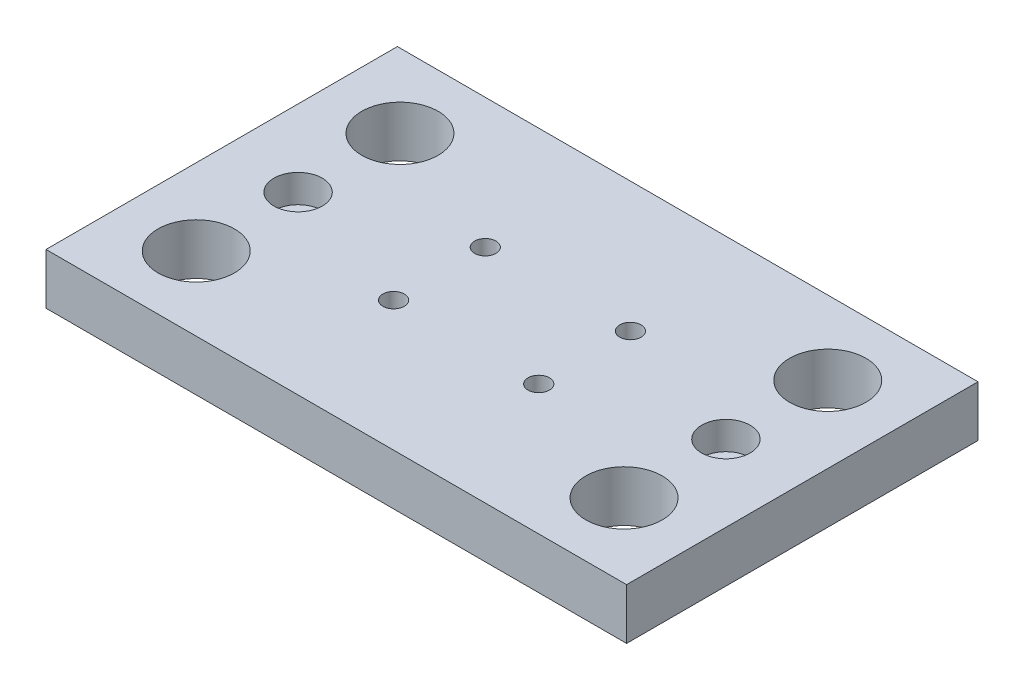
ISO-10303-21;
HEADER;
FILE_DESCRIPTION(('STEP AP214'),'2;1');
FILE_NAME('part.step','',(''),(''),'','','');
FILE_SCHEMA(('AUTOMOTIVE_DESIGN { 1 0 10303 214 1 1 1 1 }'));
ENDSEC;
DATA;
#1=APPLICATION_CONTEXT('core data for automotive mechanical design processes');
#2=APPLICATION_PROTOCOL_DEFINITION('international standard','automotive_design',2000,#1);
#3=PRODUCT_CONTEXT('',#1,'mechanical');
#4=PRODUCT('Part','Part','',(#3));
#5=PRODUCT_RELATED_PRODUCT_CATEGORY('part','',(#4));
#6=PRODUCT_DEFINITION_FORMATION('','',#4);
#7=PRODUCT_DEFINITION_CONTEXT('part definition',#1,'design');
#8=PRODUCT_DEFINITION('design','',#6,#7);
#9=PRODUCT_DEFINITION_SHAPE('','',#8);
#10=(LENGTH_UNIT() NAMED_UNIT(*) SI_UNIT(.MILLI.,.METRE.));
#11=(NAMED_UNIT(*) PLANE_ANGLE_UNIT() SI_UNIT($,.RADIAN.));
#12=(NAMED_UNIT(*) SI_UNIT($,.STERADIAN.) SOLID_ANGLE_UNIT());
#13=UNCERTAINTY_MEASURE_WITH_UNIT(LENGTH_MEASURE(1.E-05),#10,'distance_accuracy_value','');
#14=(GEOMETRIC_REPRESENTATION_CONTEXT(3) GLOBAL_UNCERTAINTY_ASSIGNED_CONTEXT((#13)) GLOBAL_UNIT_ASSIGNED_CONTEXT((#10,
#11,#12)) REPRESENTATION_CONTEXT('',''));
#15=CARTESIAN_POINT('',(0.,0.,0.));
#16=DIRECTION('',(0.,0.,1.));
#17=DIRECTION('',(1.,0.,0.));
#18=AXIS2_PLACEMENT_3D('',#15,#16,#17);
#19=CARTESIAN_POINT('',(99.,-59.,34.5));
#20=DIRECTION('',(0.,1.,0.));
#21=DIRECTION('',(0.,0.,1.));
#22=AXIS2_PLACEMENT_3D('',#19,#20,#21);
#23=CYLINDRICAL_SURFACE('',#22,2.75);
#24=CARTESIAN_POINT('',(99.,0.,34.5));
#25=DIRECTION('',(0.,1.,0.));
#26=DIRECTION('',(0.,0.,1.));
#27=AXIS2_PLACEMENT_3D('',#24,#25,#26);
#28=CIRCLE('',#27,2.75);
#29=CARTESIAN_POINT('',(99.,0.,37.25));
#30=VERTEX_POINT('',#29);
#31=EDGE_CURVE('E147',#30,#30,#28,.T.);
#32=ORIENTED_EDGE('',*,*,#31,.F.);
#33=EDGE_LOOP('',(#32));
#34=FACE_BOUND('',#33,.T.);
#35=CARTESIAN_POINT('',(99.,4.5,34.5));
#36=DIRECTION('',(0.,1.,0.));
#37=DIRECTION('',(0.,0.,1.));
#38=AXIS2_PLACEMENT_3D('',#35,#36,#37);
#39=CIRCLE('',#38,2.75);
#40=CARTESIAN_POINT('',(99.,4.5,37.25));
#41=VERTEX_POINT('',#40);
#42=EDGE_CURVE('E36',#41,#41,#39,.F.);
#43=ORIENTED_EDGE('',*,*,#42,.F.);
#44=EDGE_LOOP('',(#43));
#45=FACE_BOUND('',#44,.T.);
#46=ADVANCED_FACE('F32',(#34,#45),#23,.F.);
#47=CARTESIAN_POINT('',(15.,-59.,34.5));
#48=DIRECTION('',(0.,1.,0.));
#49=DIRECTION('',(0.,0.,1.));
#50=AXIS2_PLACEMENT_3D('',#47,#48,#49);
#51=CYLINDRICAL_SURFACE('',#50,2.75);
#52=CARTESIAN_POINT('',(15.,0.,34.5));
#53=DIRECTION('',(0.,1.,0.));
#54=DIRECTION('',(0.,0.,1.));
#55=AXIS2_PLACEMENT_3D('',#52,#53,#54);
#56=CIRCLE('',#55,2.75);
#57=CARTESIAN_POINT('',(15.,0.,37.25));
#58=VERTEX_POINT('',#57);
#59=EDGE_CURVE('E150',#58,#58,#56,.T.);
#60=ORIENTED_EDGE('',*,*,#59,.F.);
#61=EDGE_LOOP('',(#60));
#62=FACE_BOUND('',#61,.T.);
#63=CARTESIAN_POINT('',(15.,4.5,34.5));
#64=DIRECTION('',(0.,1.,0.));
#65=DIRECTION('',(0.,0.,1.));
#66=AXIS2_PLACEMENT_3D('',#63,#64,#65);
#67=CIRCLE('',#66,2.75);
#68=CARTESIAN_POINT('',(15.,4.5,37.25));
#69=VERTEX_POINT('',#68);
#70=EDGE_CURVE('E107',#69,#69,#67,.F.);
#71=ORIENTED_EDGE('',*,*,#70,.F.);
#72=EDGE_LOOP('',(#71));
#73=FACE_BOUND('',#72,.T.);
#74=ADVANCED_FACE('F195',(#62,#73),#51,.F.);
#75=CARTESIAN_POINT('',(0.,0.,69.));
#76=DIRECTION('',(1.,0.,0.));
#77=DIRECTION('',(0.,0.,-1.));
#78=AXIS2_PLACEMENT_3D('',#75,#76,#77);
#79=PLANE('',#78);
#80=DIRECTION('',(0.,-1.,0.));
#81=VECTOR('',#80,1.);
#82=CARTESIAN_POINT('',(0.,0.,0.));
#83=LINE('',#82,#81);
#84=CARTESIAN_POINT('',(0.,10.,0.));
#85=VERTEX_POINT('',#84);
#86=CARTESIAN_POINT('',(0.,0.,0.));
#87=VERTEX_POINT('',#86);
#88=EDGE_CURVE('E99',#85,#87,#83,.T.);
#89=ORIENTED_EDGE('',*,*,#88,.T.);
#90=DIRECTION('',(0.,0.,-1.));
#91=VECTOR('',#90,1.);
#92=CARTESIAN_POINT('',(0.,0.,69.));
#93=LINE('',#92,#91);
#94=CARTESIAN_POINT('',(0.,0.,69.));
#95=VERTEX_POINT('',#94);
#96=EDGE_CURVE('E11',#95,#87,#93,.T.);
#97=ORIENTED_EDGE('',*,*,#96,.F.);
#98=DIRECTION('',(0.,-1.,0.));
#99=VECTOR('',#98,1.);
#100=CARTESIAN_POINT('',(0.,0.,69.));
#101=LINE('',#100,#99);
#102=CARTESIAN_POINT('',(0.,10.,69.));
#103=VERTEX_POINT('',#102);
#104=EDGE_CURVE('E86',#103,#95,#101,.T.);
#105=ORIENTED_EDGE('',*,*,#104,.F.);
#106=DIRECTION('',(0.,0.,-1.));
#107=VECTOR('',#106,1.);
#108=CARTESIAN_POINT('',(0.,10.,69.));
#109=LINE('',#108,#107);
#110=EDGE_CURVE('E95',#103,#85,#109,.T.);
#111=ORIENTED_EDGE('',*,*,#110,.T.);
#112=EDGE_LOOP('',(#89,#97,#105,#111));
#113=FACE_BOUND('',#112,.T.);
#114=ADVANCED_FACE('F34',(#113),#79,.F.);
#115=CARTESIAN_POINT('',(0.,0.,69.));
#116=DIRECTION('',(0.,1.,0.));
#117=DIRECTION('',(0.,0.,1.));
#118=AXIS2_PLACEMENT_3D('',#115,#116,#117);
#119=PLANE('',#118);
#120=CARTESIAN_POINT('',(71.25,0.,43.5));
#121=DIRECTION('',(0.,1.,0.));
#122=DIRECTION('',(0.,0.,1.));
#123=AXIS2_PLACEMENT_3D('',#120,#121,#122);
#124=CIRCLE('',#123,2.1);
#125=CARTESIAN_POINT('',(71.25,0.,45.6));
#126=VERTEX_POINT('',#125);
#127=EDGE_CURVE('E114',#126,#126,#124,.T.);
#128=ORIENTED_EDGE('',*,*,#127,.T.);
#129=EDGE_LOOP('',(#128));
#130=FACE_BOUND('',#129,.T.);
#131=CARTESIAN_POINT('',(71.25,0.,25.5));
#132=DIRECTION('',(0.,1.,0.));
#133=DIRECTION('',(0.,0.,1.));
#134=AXIS2_PLACEMENT_3D('',#131,#132,#133);
#135=CIRCLE('',#134,2.1);
#136=CARTESIAN_POINT('',(71.25,0.,27.6));
#137=VERTEX_POINT('',#136);
#138=EDGE_CURVE('E132',#137,#137,#135,.T.);
#139=ORIENTED_EDGE('',*,*,#138,.T.);
#140=EDGE_LOOP('',(#139));
#141=FACE_BOUND('',#140,.T.);
#142=CARTESIAN_POINT('',(42.75,0.,25.5));
#143=DIRECTION('',(0.,1.,0.));
#144=DIRECTION('',(0.,0.,1.));
#145=AXIS2_PLACEMENT_3D('',#142,#143,#144);
#146=CIRCLE('',#145,2.1);
#147=CARTESIAN_POINT('',(42.75,0.,27.6));
#148=VERTEX_POINT('',#147);
#149=EDGE_CURVE('E138',#148,#148,#146,.T.);
#150=ORIENTED_EDGE('',*,*,#149,.T.);
#151=EDGE_LOOP('',(#150));
#152=FACE_BOUND('',#151,.T.);
#153=CARTESIAN_POINT('',(42.75,0.,43.5));
#154=DIRECTION('',(0.,1.,0.));
#155=DIRECTION('',(0.,0.,1.));
#156=AXIS2_PLACEMENT_3D('',#153,#154,#155);
#157=CIRCLE('',#156,2.1);
#158=CARTESIAN_POINT('',(42.75,0.,45.6));
#159=VERTEX_POINT('',#158);
#160=EDGE_CURVE('E144',#159,#159,#157,.T.);
#161=ORIENTED_EDGE('',*,*,#160,.T.);
#162=EDGE_LOOP('',(#161));
#163=FACE_BOUND('',#162,.T.);
#164=ORIENTED_EDGE('',*,*,#31,.T.);
#165=EDGE_LOOP('',(#164));
#166=FACE_BOUND('',#165,.T.);
#167=ORIENTED_EDGE('',*,*,#59,.T.);
#168=EDGE_LOOP('',(#167));
#169=FACE_BOUND('',#168,.T.);
#170=CARTESIAN_POINT('',(15.,0.,54.5));
#171=DIRECTION('',(0.,1.,0.));
#172=DIRECTION('',(0.,0.,1.));
#173=AXIS2_PLACEMENT_3D('',#170,#171,#172);
#174=CIRCLE('',#173,7.5);
#175=CARTESIAN_POINT('',(15.,0.,62.));
#176=VERTEX_POINT('',#175);
#177=EDGE_CURVE('E156',#176,#176,#174,.T.);
#178=ORIENTED_EDGE('',*,*,#177,.T.);
#179=EDGE_LOOP('',(#178));
#180=FACE_BOUND('',#179,.T.);
#181=CARTESIAN_POINT('',(99.,0.,54.5));
#182=DIRECTION('',(0.,1.,0.));
#183=DIRECTION('',(0.,0.,1.));
#184=AXIS2_PLACEMENT_3D('',#181,#182,#183);
#185=CIRCLE('',#184,7.50000000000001);
#186=CARTESIAN_POINT('',(99.,0.,62.));
#187=VERTEX_POINT('',#186);
#188=EDGE_CURVE('E162',#187,#187,#185,.T.);
#189=ORIENTED_EDGE('',*,*,#188,.T.);
#190=EDGE_LOOP('',(#189));
#191=FACE_BOUND('',#190,.T.);
#192=CARTESIAN_POINT('',(99.,0.,14.5));
#193=DIRECTION('',(0.,1.,0.));
#194=DIRECTION('',(0.,0.,1.));
#195=AXIS2_PLACEMENT_3D('',#192,#193,#194);
#196=CIRCLE('',#195,7.50000000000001);
#197=CARTESIAN_POINT('',(99.,0.,22.));
#198=VERTEX_POINT('',#197);
#199=EDGE_CURVE('E168',#198,#198,#196,.T.);
#200=ORIENTED_EDGE('',*,*,#199,.T.);
#201=EDGE_LOOP('',(#200));
#202=FACE_BOUND('',#201,.T.);
#203=CARTESIAN_POINT('',(15.,0.,14.5));
#204=DIRECTION('',(0.,1.,0.));
#205=DIRECTION('',(0.,0.,1.));
#206=AXIS2_PLACEMENT_3D('',#203,#204,#205);
#207=CIRCLE('',#206,7.5);
#208=CARTESIAN_POINT('',(15.,0.,22.));
#209=VERTEX_POINT('',#208);
#210=EDGE_CURVE('E102',#209,#209,#207,.T.);
#211=ORIENTED_EDGE('',*,*,#210,.T.);
#212=EDGE_LOOP('',(#211));
#213=FACE_BOUND('',#212,.T.);
#214=DIRECTION('',(1.,0.,0.));
#215=VECTOR('',#214,1.);
#216=CARTESIAN_POINT('',(0.,0.,0.));
#217=LINE('',#216,#215);
#218=CARTESIAN_POINT('',(114.,0.,0.));
#219=VERTEX_POINT('',#218);
#220=EDGE_CURVE('E90',#87,#219,#217,.T.);
#221=ORIENTED_EDGE('',*,*,#220,.T.);
#222=DIRECTION('',(0.,0.,-1.));
#223=VECTOR('',#222,1.);
#224=CARTESIAN_POINT('',(114.,0.,69.));
#225=LINE('',#224,#223);
#226=CARTESIAN_POINT('',(114.,0.,69.));
#227=VERTEX_POINT('',#226);
#228=EDGE_CURVE('E42',#227,#219,#225,.T.);
#229=ORIENTED_EDGE('',*,*,#228,.F.);
#230=DIRECTION('',(1.,0.,0.));
#231=VECTOR('',#230,1.);
#232=CARTESIAN_POINT('',(0.,0.,69.));
#233=LINE('',#232,#231);
#234=EDGE_CURVE('E81',#95,#227,#233,.T.);
#235=ORIENTED_EDGE('',*,*,#234,.F.);
#236=ORIENTED_EDGE('',*,*,#96,.T.);
#237=EDGE_LOOP('',(#221,#229,#235,#236));
#238=FACE_BOUND('',#237,.T.);
#239=ADVANCED_FACE('F89',(#130,#141,#152,#163,#166,#169,#180,#191,#202,#213,#238),#119,.F.);
#240=CARTESIAN_POINT('',(114.,0.,69.));
#241=DIRECTION('',(-1.,0.,0.));
#242=DIRECTION('',(0.,0.,1.));
#243=AXIS2_PLACEMENT_3D('',#240,#241,#242);
#244=PLANE('',#243);
#245=DIRECTION('',(0.,1.,0.));
#246=VECTOR('',#245,1.);
#247=CARTESIAN_POINT('',(114.,0.,0.));
#248=LINE('',#247,#246);
#249=CARTESIAN_POINT('',(114.,10.,0.));
#250=VERTEX_POINT('',#249);
#251=EDGE_CURVE('E68',#219,#250,#248,.T.);
#252=ORIENTED_EDGE('',*,*,#251,.T.);
#253=DIRECTION('',(0.,0.,-1.));
#254=VECTOR('',#253,1.);
#255=CARTESIAN_POINT('',(114.,10.,69.));
#256=LINE('',#255,#254);
#257=CARTESIAN_POINT('',(114.,10.,69.));
#258=VERTEX_POINT('',#257);
#259=EDGE_CURVE('E91',#258,#250,#256,.T.);
#260=ORIENTED_EDGE('',*,*,#259,.F.);
#261=DIRECTION('',(0.,1.,0.));
#262=VECTOR('',#261,1.);
#263=CARTESIAN_POINT('',(114.,0.,69.));
#264=LINE('',#263,#262);
#265=EDGE_CURVE('E84',#227,#258,#264,.T.);
#266=ORIENTED_EDGE('',*,*,#265,.F.);
#267=ORIENTED_EDGE('',*,*,#228,.T.);
#268=EDGE_LOOP('',(#252,#260,#266,#267));
#269=FACE_BOUND('',#268,.T.);
#270=ADVANCED_FACE('F93',(#269),#244,.F.);
#271=CARTESIAN_POINT('',(0.,10.,69.));
#272=DIRECTION('',(0.,-1.,0.));
#273=DIRECTION('',(0.,0.,-1.));
#274=AXIS2_PLACEMENT_3D('',#271,#272,#273);
#275=PLANE('',#274);
#276=CARTESIAN_POINT('',(99.,10.,34.5));
#277=DIRECTION('',(0.,1.,0.));
#278=DIRECTION('',(0.,0.,1.));
#279=AXIS2_PLACEMENT_3D('',#276,#277,#278);
#280=CIRCLE('',#279,4.75);
#281=CARTESIAN_POINT('',(99.,10.,39.25));
#282=VERTEX_POINT('',#281);
#283=EDGE_CURVE('E124',#282,#282,#280,.T.);
#284=ORIENTED_EDGE('',*,*,#283,.F.);
#285=EDGE_LOOP('',(#284));
#286=FACE_BOUND('',#285,.T.);
#287=CARTESIAN_POINT('',(15.,10.,34.5));
#288=DIRECTION('',(0.,1.,0.));
#289=DIRECTION('',(0.,0.,1.));
#290=AXIS2_PLACEMENT_3D('',#287,#288,#289);
#291=CIRCLE('',#290,4.75);
#292=CARTESIAN_POINT('',(15.,10.,39.25));
#293=VERTEX_POINT('',#292);
#294=EDGE_CURVE('E117',#293,#293,#291,.T.);
#295=ORIENTED_EDGE('',*,*,#294,.F.);
#296=EDGE_LOOP('',(#295));
#297=FACE_BOUND('',#296,.T.);
#298=CARTESIAN_POINT('',(71.25,10.,43.5));
#299=DIRECTION('',(0.,1.,0.));
#300=DIRECTION('',(0.,0.,1.));
#301=AXIS2_PLACEMENT_3D('',#298,#299,#300);
#302=CIRCLE('',#301,2.1);
#303=CARTESIAN_POINT('',(71.25,10.,45.6));
#304=VERTEX_POINT('',#303);
#305=EDGE_CURVE('E109',#304,#304,#302,.T.);
#306=ORIENTED_EDGE('',*,*,#305,.F.);
#307=EDGE_LOOP('',(#306));
#308=FACE_BOUND('',#307,.T.);
#309=CARTESIAN_POINT('',(71.25,10.,25.5));
#310=DIRECTION('',(0.,1.,0.));
#311=DIRECTION('',(0.,0.,1.));
#312=AXIS2_PLACEMENT_3D('',#309,#310,#311);
#313=CIRCLE('',#312,2.1);
#314=CARTESIAN_POINT('',(71.25,10.,27.6));
#315=VERTEX_POINT('',#314);
#316=EDGE_CURVE('E129',#315,#315,#313,.T.);
#317=ORIENTED_EDGE('',*,*,#316,.F.);
#318=EDGE_LOOP('',(#317));
#319=FACE_BOUND('',#318,.T.);
#320=CARTESIAN_POINT('',(42.75,10.,25.5));
#321=DIRECTION('',(0.,1.,0.));
#322=DIRECTION('',(0.,0.,1.));
#323=AXIS2_PLACEMENT_3D('',#320,#321,#322);
#324=CIRCLE('',#323,2.1);
#325=CARTESIAN_POINT('',(42.75,10.,27.6));
#326=VERTEX_POINT('',#325);
#327=EDGE_CURVE('E135',#326,#326,#324,.T.);
#328=ORIENTED_EDGE('',*,*,#327,.F.);
#329=EDGE_LOOP('',(#328));
#330=FACE_BOUND('',#329,.T.);
#331=CARTESIAN_POINT('',(42.75,10.,43.5));
#332=DIRECTION('',(0.,1.,0.));
#333=DIRECTION('',(0.,0.,1.));
#334=AXIS2_PLACEMENT_3D('',#331,#332,#333);
#335=CIRCLE('',#334,2.1);
#336=CARTESIAN_POINT('',(42.75,10.,45.6));
#337=VERTEX_POINT('',#336);
#338=EDGE_CURVE('E141',#337,#337,#335,.T.);
#339=ORIENTED_EDGE('',*,*,#338,.F.);
#340=EDGE_LOOP('',(#339));
#341=FACE_BOUND('',#340,.T.);
#342=CARTESIAN_POINT('',(15.,10.,54.5));
#343=DIRECTION('',(0.,1.,0.));
#344=DIRECTION('',(0.,0.,1.));
#345=AXIS2_PLACEMENT_3D('',#342,#343,#344);
#346=CIRCLE('',#345,7.5);
#347=CARTESIAN_POINT('',(15.,10.,62.));
#348=VERTEX_POINT('',#347);
#349=EDGE_CURVE('E153',#348,#348,#346,.T.);
#350=ORIENTED_EDGE('',*,*,#349,.F.);
#351=EDGE_LOOP('',(#350));
#352=FACE_BOUND('',#351,.T.);
#353=CARTESIAN_POINT('',(99.,10.,54.5));
#354=DIRECTION('',(0.,1.,0.));
#355=DIRECTION('',(0.,0.,1.));
#356=AXIS2_PLACEMENT_3D('',#353,#354,#355);
#357=CIRCLE('',#356,7.50000000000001);
#358=CARTESIAN_POINT('',(99.,10.,62.));
#359=VERTEX_POINT('',#358);
#360=EDGE_CURVE('E159',#359,#359,#357,.T.);
#361=ORIENTED_EDGE('',*,*,#360,.F.);
#362=EDGE_LOOP('',(#361));
#363=FACE_BOUND('',#362,.T.);
#364=CARTESIAN_POINT('',(99.,10.,14.5));
#365=DIRECTION('',(0.,1.,0.));
#366=DIRECTION('',(0.,0.,1.));
#367=AXIS2_PLACEMENT_3D('',#364,#365,#366);
#368=CIRCLE('',#367,7.50000000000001);
#369=CARTESIAN_POINT('',(99.,10.,22.));
#370=VERTEX_POINT('',#369);
#371=EDGE_CURVE('E165',#370,#370,#368,.T.);
#372=ORIENTED_EDGE('',*,*,#371,.F.);
#373=EDGE_LOOP('',(#372));
#374=FACE_BOUND('',#373,.T.);
#375=CARTESIAN_POINT('',(15.,10.,14.5));
#376=DIRECTION('',(0.,1.,0.));
#377=DIRECTION('',(0.,0.,1.));
#378=AXIS2_PLACEMENT_3D('',#375,#376,#377);
#379=CIRCLE('',#378,7.5);
#380=CARTESIAN_POINT('',(15.,10.,22.));
#381=VERTEX_POINT('',#380);
#382=EDGE_CURVE('E171',#381,#381,#379,.T.);
#383=ORIENTED_EDGE('',*,*,#382,.F.);
#384=EDGE_LOOP('',(#383));
#385=FACE_BOUND('',#384,.T.);
#386=DIRECTION('',(-1.,0.,0.));
#387=VECTOR('',#386,1.);
#388=CARTESIAN_POINT('',(0.,10.,0.));
#389=LINE('',#388,#387);
#390=EDGE_CURVE('E74',#250,#85,#389,.T.);
#391=ORIENTED_EDGE('',*,*,#390,.T.);
#392=ORIENTED_EDGE('',*,*,#110,.F.);
#393=DIRECTION('',(-1.,0.,0.));
#394=VECTOR('',#393,1.);
#395=CARTESIAN_POINT('',(0.,10.,69.));
#396=LINE('',#395,#394);
#397=EDGE_CURVE('E51',#258,#103,#396,.T.);
#398=ORIENTED_EDGE('',*,*,#397,.F.);
#399=ORIENTED_EDGE('',*,*,#259,.T.);
#400=EDGE_LOOP('',(#391,#392,#398,#399));
#401=FACE_BOUND('',#400,.T.);
#402=ADVANCED_FACE('F230',(#286,#297,#308,#319,#330,#341,#352,#363,#374,#385,#401),#275,.F.);
#403=CARTESIAN_POINT('',(0.,10.,69.));
#404=DIRECTION('',(0.,0.,-1.));
#405=DIRECTION('',(-1.,0.,0.));
#406=AXIS2_PLACEMENT_3D('',#403,#404,#405);
#407=PLANE('',#406);
#408=ORIENTED_EDGE('',*,*,#104,.T.);
#409=ORIENTED_EDGE('',*,*,#234,.T.);
#410=ORIENTED_EDGE('',*,*,#265,.T.);
#411=ORIENTED_EDGE('',*,*,#397,.T.);
#412=EDGE_LOOP('',(#408,#409,#410,#411));
#413=FACE_BOUND('',#412,.T.);
#414=ADVANCED_FACE('F82',(#413),#407,.F.);
#415=CARTESIAN_POINT('',(0.,10.,0.));
#416=DIRECTION('',(0.,0.,-1.));
#417=DIRECTION('',(-1.,0.,0.));
#418=AXIS2_PLACEMENT_3D('',#415,#416,#417);
#419=PLANE('',#418);
#420=ORIENTED_EDGE('',*,*,#88,.F.);
#421=ORIENTED_EDGE('',*,*,#390,.F.);
#422=ORIENTED_EDGE('',*,*,#251,.F.);
#423=ORIENTED_EDGE('',*,*,#220,.F.);
#424=EDGE_LOOP('',(#420,#421,#422,#423));
#425=FACE_BOUND('',#424,.T.);
#426=ADVANCED_FACE('F181',(#425),#419,.T.);
#427=CARTESIAN_POINT('',(15.,-59.,14.5));
#428=DIRECTION('',(0.,1.,0.));
#429=DIRECTION('',(0.,0.,1.));
#430=AXIS2_PLACEMENT_3D('',#427,#428,#429);
#431=CYLINDRICAL_SURFACE('',#430,7.5);
#432=ORIENTED_EDGE('',*,*,#382,.T.);
#433=EDGE_LOOP('',(#432));
#434=FACE_BOUND('',#433,.T.);
#435=ORIENTED_EDGE('',*,*,#210,.F.);
#436=EDGE_LOOP('',(#435));
#437=FACE_BOUND('',#436,.T.);
#438=ADVANCED_FACE('F178',(#434,#437),#431,.F.);
#439=CARTESIAN_POINT('',(99.,-59.,14.5));
#440=DIRECTION('',(0.,1.,0.));
#441=DIRECTION('',(0.,0.,1.));
#442=AXIS2_PLACEMENT_3D('',#439,#440,#441);
#443=CYLINDRICAL_SURFACE('',#442,7.50000000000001);
#444=ORIENTED_EDGE('',*,*,#371,.T.);
#445=EDGE_LOOP('',(#444));
#446=FACE_BOUND('',#445,.T.);
#447=ORIENTED_EDGE('',*,*,#199,.F.);
#448=EDGE_LOOP('',(#447));
#449=FACE_BOUND('',#448,.T.);
#450=ADVANCED_FACE('F180',(#446,#449),#443,.F.);
#451=CARTESIAN_POINT('',(99.,-59.,54.5));
#452=DIRECTION('',(0.,1.,0.));
#453=DIRECTION('',(0.,0.,1.));
#454=AXIS2_PLACEMENT_3D('',#451,#452,#453);
#455=CYLINDRICAL_SURFACE('',#454,7.50000000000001);
#456=ORIENTED_EDGE('',*,*,#360,.T.);
#457=EDGE_LOOP('',(#456));
#458=FACE_BOUND('',#457,.T.);
#459=ORIENTED_EDGE('',*,*,#188,.F.);
#460=EDGE_LOOP('',(#459));
#461=FACE_BOUND('',#460,.T.);
#462=ADVANCED_FACE('F188',(#458,#461),#455,.F.);
#463=CARTESIAN_POINT('',(15.,-59.,54.5));
#464=DIRECTION('',(0.,1.,0.));
#465=DIRECTION('',(0.,0.,1.));
#466=AXIS2_PLACEMENT_3D('',#463,#464,#465);
#467=CYLINDRICAL_SURFACE('',#466,7.5);
#468=ORIENTED_EDGE('',*,*,#349,.T.);
#469=EDGE_LOOP('',(#468));
#470=FACE_BOUND('',#469,.T.);
#471=ORIENTED_EDGE('',*,*,#177,.F.);
#472=EDGE_LOOP('',(#471));
#473=FACE_BOUND('',#472,.T.);
#474=ADVANCED_FACE('F209',(#470,#473),#467,.F.);
#475=CARTESIAN_POINT('',(42.75,-59.,43.5));
#476=DIRECTION('',(0.,1.,0.));
#477=DIRECTION('',(0.,0.,1.));
#478=AXIS2_PLACEMENT_3D('',#475,#476,#477);
#479=CYLINDRICAL_SURFACE('',#478,2.1);
#480=ORIENTED_EDGE('',*,*,#338,.T.);
#481=EDGE_LOOP('',(#480));
#482=FACE_BOUND('',#481,.T.);
#483=ORIENTED_EDGE('',*,*,#160,.F.);
#484=EDGE_LOOP('',(#483));
#485=FACE_BOUND('',#484,.T.);
#486=ADVANCED_FACE('F206',(#482,#485),#479,.F.);
#487=CARTESIAN_POINT('',(42.75,-59.,25.5));
#488=DIRECTION('',(0.,1.,0.));
#489=DIRECTION('',(0.,0.,1.));
#490=AXIS2_PLACEMENT_3D('',#487,#488,#489);
#491=CYLINDRICAL_SURFACE('',#490,2.1);
#492=ORIENTED_EDGE('',*,*,#327,.T.);
#493=EDGE_LOOP('',(#492));
#494=FACE_BOUND('',#493,.T.);
#495=ORIENTED_EDGE('',*,*,#149,.F.);
#496=EDGE_LOOP('',(#495));
#497=FACE_BOUND('',#496,.T.);
#498=ADVANCED_FACE('F282',(#494,#497),#491,.F.);
#499=CARTESIAN_POINT('',(71.25,-59.,25.5));
#500=DIRECTION('',(0.,1.,0.));
#501=DIRECTION('',(0.,0.,1.));
#502=AXIS2_PLACEMENT_3D('',#499,#500,#501);
#503=CYLINDRICAL_SURFACE('',#502,2.1);
#504=ORIENTED_EDGE('',*,*,#316,.T.);
#505=EDGE_LOOP('',(#504));
#506=FACE_BOUND('',#505,.T.);
#507=ORIENTED_EDGE('',*,*,#138,.F.);
#508=EDGE_LOOP('',(#507));
#509=FACE_BOUND('',#508,.T.);
#510=ADVANCED_FACE('F291',(#506,#509),#503,.F.);
#511=CARTESIAN_POINT('',(71.25,-59.,43.5));
#512=DIRECTION('',(0.,1.,0.));
#513=DIRECTION('',(0.,0.,1.));
#514=AXIS2_PLACEMENT_3D('',#511,#512,#513);
#515=CYLINDRICAL_SURFACE('',#514,2.1);
#516=ORIENTED_EDGE('',*,*,#305,.T.);
#517=EDGE_LOOP('',(#516));
#518=FACE_BOUND('',#517,.T.);
#519=ORIENTED_EDGE('',*,*,#127,.F.);
#520=EDGE_LOOP('',(#519));
#521=FACE_BOUND('',#520,.T.);
#522=ADVANCED_FACE('F300',(#518,#521),#515,.F.);
#523=CARTESIAN_POINT('',(15.,4.5,34.5));
#524=DIRECTION('',(0.,1.,0.));
#525=DIRECTION('',(0.,0.,1.));
#526=AXIS2_PLACEMENT_3D('',#523,#524,#525);
#527=PLANE('',#526);
#528=CARTESIAN_POINT('',(15.,4.5,34.5));
#529=DIRECTION('',(0.,1.,0.));
#530=DIRECTION('',(0.,0.,1.));
#531=AXIS2_PLACEMENT_3D('',#528,#529,#530);
#532=CIRCLE('',#531,4.75);
#533=CARTESIAN_POINT('',(15.,4.5,39.25));
#534=VERTEX_POINT('',#533);
#535=EDGE_CURVE('E110',#534,#534,#532,.T.);
#536=ORIENTED_EDGE('',*,*,#535,.T.);
#537=EDGE_LOOP('',(#536));
#538=FACE_BOUND('',#537,.T.);
#539=ORIENTED_EDGE('',*,*,#70,.T.);
#540=EDGE_LOOP('',(#539));
#541=FACE_BOUND('',#540,.T.);
#542=ADVANCED_FACE('F309',(#538,#541),#527,.T.);
#543=CARTESIAN_POINT('',(15.,4.5,34.5));
#544=DIRECTION('',(0.,1.,0.));
#545=DIRECTION('',(0.,0.,1.));
#546=AXIS2_PLACEMENT_3D('',#543,#544,#545);
#547=CYLINDRICAL_SURFACE('',#546,4.75);
#548=ORIENTED_EDGE('',*,*,#535,.F.);
#549=EDGE_LOOP('',(#548));
#550=FACE_BOUND('',#549,.T.);
#551=ORIENTED_EDGE('',*,*,#294,.T.);
#552=EDGE_LOOP('',(#551));
#553=FACE_BOUND('',#552,.T.);
#554=ADVANCED_FACE('F334',(#550,#553),#547,.F.);
#555=CARTESIAN_POINT('',(99.,4.5,34.5));
#556=DIRECTION('',(0.,1.,0.));
#557=DIRECTION('',(0.,0.,1.));
#558=AXIS2_PLACEMENT_3D('',#555,#556,#557);
#559=PLANE('',#558);
#560=CARTESIAN_POINT('',(99.,4.5,34.5));
#561=DIRECTION('',(0.,1.,0.));
#562=DIRECTION('',(0.,0.,1.));
#563=AXIS2_PLACEMENT_3D('',#560,#561,#562);
#564=CIRCLE('',#563,4.75);
#565=CARTESIAN_POINT('',(99.,4.5,39.25));
#566=VERTEX_POINT('',#565);
#567=EDGE_CURVE('E370',#566,#566,#564,.T.);
#568=ORIENTED_EDGE('',*,*,#567,.T.);
#569=EDGE_LOOP('',(#568));
#570=FACE_BOUND('',#569,.T.);
#571=ORIENTED_EDGE('',*,*,#42,.T.);
#572=EDGE_LOOP('',(#571));
#573=FACE_BOUND('',#572,.T.);
#574=ADVANCED_FACE('F343',(#570,#573),#559,.T.);
#575=CARTESIAN_POINT('',(99.,4.5,34.5));
#576=DIRECTION('',(0.,1.,0.));
#577=DIRECTION('',(0.,0.,1.));
#578=AXIS2_PLACEMENT_3D('',#575,#576,#577);
#579=CYLINDRICAL_SURFACE('',#578,4.75);
#580=ORIENTED_EDGE('',*,*,#567,.F.);
#581=EDGE_LOOP('',(#580));
#582=FACE_BOUND('',#581,.T.);
#583=ORIENTED_EDGE('',*,*,#283,.T.);
#584=EDGE_LOOP('',(#583));
#585=FACE_BOUND('',#584,.T.);
#586=ADVANCED_FACE('F353',(#582,#585),#579,.F.);
#587=CLOSED_SHELL('',(#46,#74,#114,#239,#270,#402,#414,#426,#438,#450,#462,#474,#486,#498,#510,
#522,#542,#554,#574,#586));
#588=MANIFOLD_SOLID_BREP('B2',#587);
#589=ADVANCED_BREP_SHAPE_REPRESENTATION('',(#18,#588),#14);
#590=SHAPE_DEFINITION_REPRESENTATION(#9,#589);
ENDSEC;
END-ISO-10303-21;
